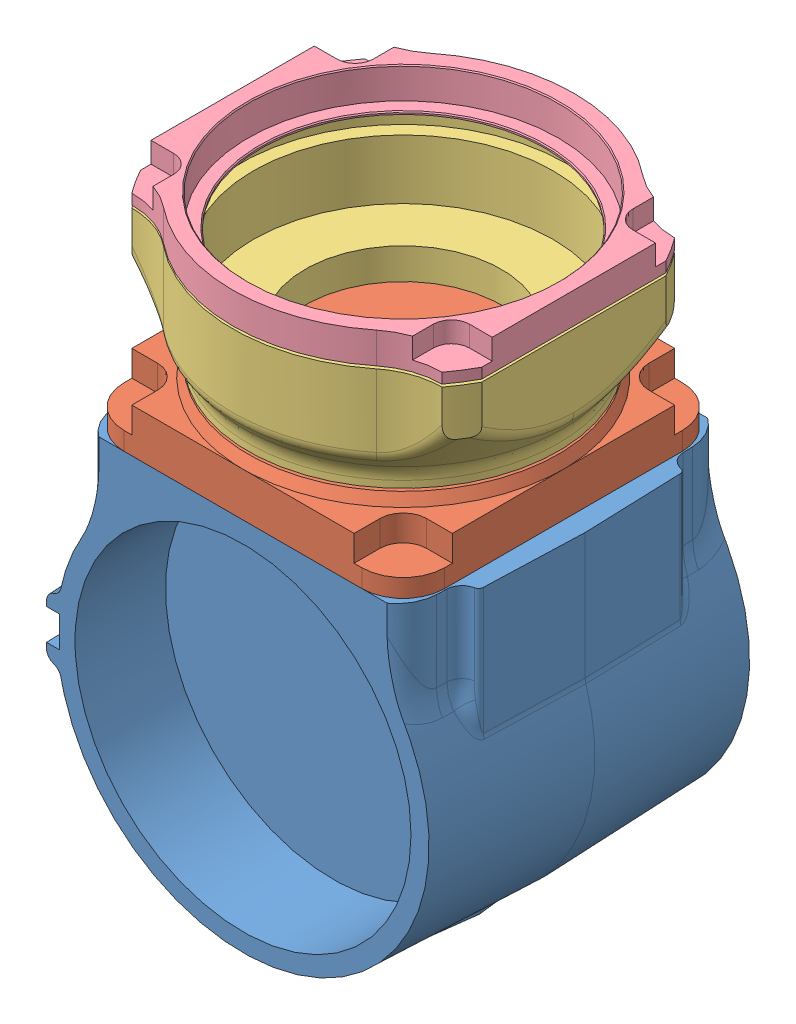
SolidWorks assembly GP7_B_AXIS.sldasm, configuration Default (file format 13000). Lengths in mm.
Overall size (76.59 114 77.77).
4 component instances, 4 part files, 0 mates.
Components (placement in the parent):
- BAXIS_WRISTBASE-1: BAXIS_WRISTBASE.SLDPRT [Default] at origin size (76.17 74.5 77.77)
- BAXIS_HOUSING-1: BAXIS_HOUSING.SLDPRT [Default] at (0 36.5 0) x (1 0 0) z (0 0 -1) size (62 13 62)
- BAXIS_HOUSING2-1: BAXIS_HOUSING2.SLDPRT [Default] at (0 47.5 0) x (0 1 0) z (0 0 1) size (22 75.01 66)
- BAXIS_HOUSING3-1: BAXIS_HOUSING3.SLDPRT [Default] at (0 70 0) x (0 1 0) z (0 0 -1) size (6.5 66 66)
